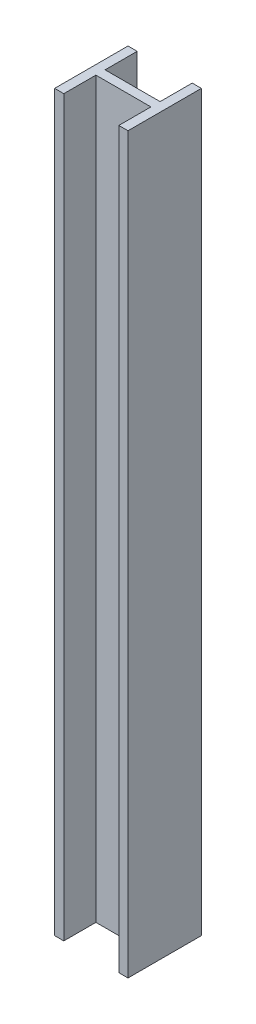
from build123d import *

# Parameters (mm, degrees)
BOSS_EXTRUDE1_DEPTH = 508


with BuildPart() as part:
    # Sketch1 → Boss-Extrude1 (new body)
    with BuildSketch(Plane(origin=(0, 0, 0), x_dir=(1, 0, 0), z_dir=(0, 1, 0))):
        Polygon((-19.05, 0), (19.05, 0), (19.05, 22.225), (25.4, 22.225), (25.4, -28.575), (19.05, -28.575), (19.05, -6.35), (-19.05, -6.35), (-19.05, -28.575), (-25.4, -28.575), (-25.4, 22.225), (-19.05, 22.225), align=None)
    extrude(amount=BOSS_EXTRUDE1_DEPTH)


solid = part.part
